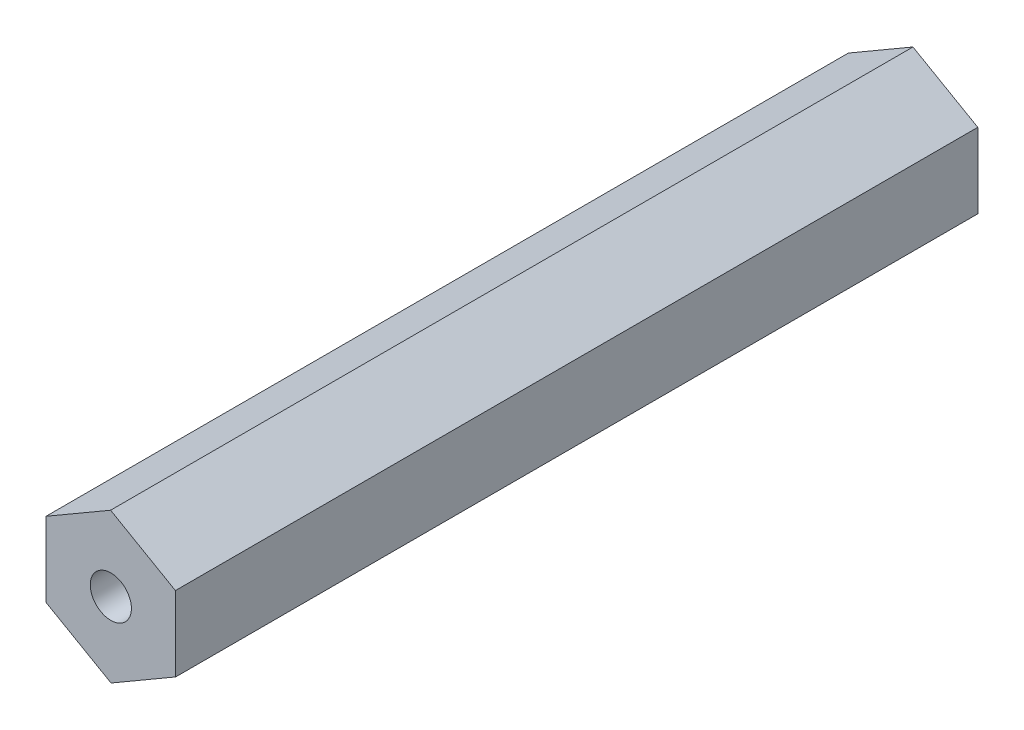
from build123d import *

# Parameters (mm, degrees)
SKETCH1_R           = 2.0193
BOSS_EXTRUDE1_DEPTH = 78.74


with BuildPart() as part:
    # Sketch1 → Boss-Extrude1 (new body)
    with BuildSketch(Plane.XY):
        Polygon((6.361095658, -3.64688845), (6.338845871, 3.685426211), (-0.022249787, 7.33231466), (-6.361095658, 3.64688845), (-6.338845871, -3.685426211), (0.022249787, -7.33231466), align=None)
        Circle(SKETCH1_R, mode=Mode.SUBTRACT)
    extrude(amount=BOSS_EXTRUDE1_DEPTH)


solid = part.part
